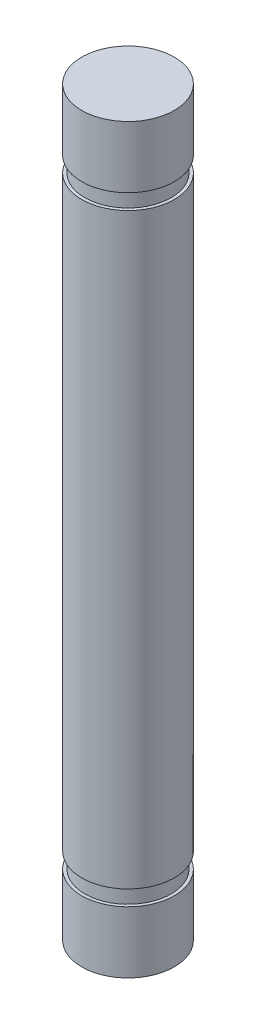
from build123d import *

# Parameters (mm, degrees)
SKETCH1_R           = 1.5
BOSS_EXTRUDE1_DEPTH = 9.525
SKETCH2_R           = 1.4
BOSS_EXTRUDE2_DEPTH = 0.5
BOSS_EXTRUDE3_START = 2
SKETCH3_R           = 1.5
BOSS_EXTRUDE3_DEPTH = 2


with BuildPart() as part:
    # Sketch1 → Boss-Extrude1 (new, symmetric)
    with BuildSketch(Plane(origin=(0, 0, 0), x_dir=(1, 0, 0), z_dir=(0, 1, 0))):
        with Locations(Location((0, 0, 0), (0, 0, 90))):
            Circle(SKETCH1_R)
    extrude(amount=BOSS_EXTRUDE1_DEPTH, both=True)

    # Sketch2 → Boss-Extrude2 (add)
    with BuildSketch(Plane(origin=(0, 9.525, 0), x_dir=(1, 0, 0), z_dir=(0, 1, 0))):
        with Locations(Location((0, 0, 0), (0, 0, 270))):
            Circle(SKETCH2_R)
    boss_extrude2 = extrude(amount=BOSS_EXTRUDE2_DEPTH)

    # Sketch3 → Boss-Extrude3 (add)
    with BuildSketch(Plane(origin=(0, 10.025, 0), x_dir=(1, 0, 0), z_dir=(0, 1, 0)).offset(BOSS_EXTRUDE3_START)):
        with Locations(Location((0, 0, 0), (0, 0, 90))):
            Circle(SKETCH3_R)
    boss_extrude3 = extrude(amount=-BOSS_EXTRUDE3_DEPTH)

    # Mirror1: Boss-Extrude2, Boss-Extrude3 across plane
    add(boss_extrude2.mirror(Plane.ZX))
    add(boss_extrude3.mirror(Plane.ZX))


solid = part.part
